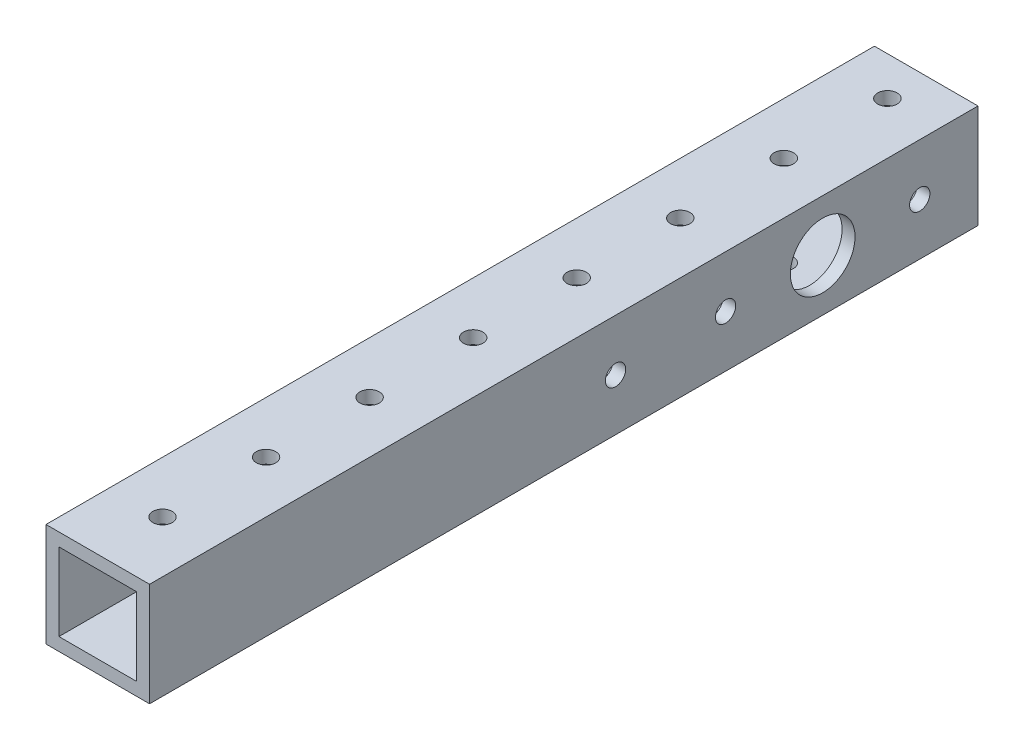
ISO-10303-21;
HEADER;
FILE_DESCRIPTION(('STEP AP214'),'2;1');
FILE_NAME('part.step','',(''),(''),'','','');
FILE_SCHEMA(('AUTOMOTIVE_DESIGN { 1 0 10303 214 1 1 1 1 }'));
ENDSEC;
DATA;
#1=APPLICATION_CONTEXT('core data for automotive mechanical design processes');
#2=APPLICATION_PROTOCOL_DEFINITION('international standard','automotive_design',2000,#1);
#3=PRODUCT_CONTEXT('',#1,'mechanical');
#4=PRODUCT('Part','Part','',(#3));
#5=PRODUCT_RELATED_PRODUCT_CATEGORY('part','',(#4));
#6=PRODUCT_DEFINITION_FORMATION('','',#4);
#7=PRODUCT_DEFINITION_CONTEXT('part definition',#1,'design');
#8=PRODUCT_DEFINITION('design','',#6,#7);
#9=PRODUCT_DEFINITION_SHAPE('','',#8);
#10=(LENGTH_UNIT() NAMED_UNIT(*) SI_UNIT(.MILLI.,.METRE.));
#11=(NAMED_UNIT(*) PLANE_ANGLE_UNIT() SI_UNIT($,.RADIAN.));
#12=(NAMED_UNIT(*) SI_UNIT($,.STERADIAN.) SOLID_ANGLE_UNIT());
#13=UNCERTAINTY_MEASURE_WITH_UNIT(LENGTH_MEASURE(1.E-05),#10,'distance_accuracy_value','');
#14=(GEOMETRIC_REPRESENTATION_CONTEXT(3) GLOBAL_UNCERTAINTY_ASSIGNED_CONTEXT((#13)) GLOBAL_UNIT_ASSIGNED_CONTEXT((#10,
#11,#12)) REPRESENTATION_CONTEXT('',''));
#15=CARTESIAN_POINT('',(0.,0.,0.));
#16=DIRECTION('',(0.,0.,1.));
#17=DIRECTION('',(1.,0.,0.));
#18=AXIS2_PLACEMENT_3D('',#15,#16,#17);
#19=CARTESIAN_POINT('',(0.,0.,101.6));
#20=DIRECTION('',(0.,0.,-1.));
#21=DIRECTION('',(-1.,0.,0.));
#22=AXIS2_PLACEMENT_3D('',#19,#20,#21);
#23=PLANE('',#22);
#24=DIRECTION('',(0.,1.,0.));
#25=VECTOR('',#24,1.);
#26=CARTESIAN_POINT('',(12.7,-12.7,101.6));
#27=LINE('',#26,#25);
#28=CARTESIAN_POINT('',(12.7,-12.7,101.6));
#29=VERTEX_POINT('',#28);
#30=CARTESIAN_POINT('',(12.7,12.7,101.6));
#31=VERTEX_POINT('',#30);
#32=EDGE_CURVE('E139',#29,#31,#27,.T.);
#33=ORIENTED_EDGE('',*,*,#32,.T.);
#34=DIRECTION('',(-1.,0.,0.));
#35=VECTOR('',#34,1.);
#36=CARTESIAN_POINT('',(-12.7,12.7,101.6));
#37=LINE('',#36,#35);
#38=CARTESIAN_POINT('',(-12.7,12.7,101.6));
#39=VERTEX_POINT('',#38);
#40=EDGE_CURVE('E142',#31,#39,#37,.T.);
#41=ORIENTED_EDGE('',*,*,#40,.T.);
#42=DIRECTION('',(0.,-1.,0.));
#43=VECTOR('',#42,1.);
#44=CARTESIAN_POINT('',(-12.7,-12.7,101.6));
#45=LINE('',#44,#43);
#46=CARTESIAN_POINT('',(-12.7,-12.7,101.6));
#47=VERTEX_POINT('',#46);
#48=EDGE_CURVE('E145',#39,#47,#45,.T.);
#49=ORIENTED_EDGE('',*,*,#48,.T.);
#50=DIRECTION('',(1.,0.,0.));
#51=VECTOR('',#50,1.);
#52=CARTESIAN_POINT('',(-12.7,-12.7,101.6));
#53=LINE('',#52,#51);
#54=EDGE_CURVE('E147',#47,#29,#53,.T.);
#55=ORIENTED_EDGE('',*,*,#54,.T.);
#56=EDGE_LOOP('',(#33,#41,#49,#55));
#57=FACE_BOUND('',#56,.T.);
#58=DIRECTION('',(0.,1.,0.));
#59=VECTOR('',#58,1.);
#60=CARTESIAN_POINT('',(9.525,-9.525,101.6));
#61=LINE('',#60,#59);
#62=CARTESIAN_POINT('',(9.525,-9.525,101.6));
#63=VERTEX_POINT('',#62);
#64=CARTESIAN_POINT('',(9.525,9.525,101.6));
#65=VERTEX_POINT('',#64);
#66=EDGE_CURVE('E100',#63,#65,#61,.T.);
#67=ORIENTED_EDGE('',*,*,#66,.F.);
#68=DIRECTION('',(1.,0.,0.));
#69=VECTOR('',#68,1.);
#70=CARTESIAN_POINT('',(-9.525,-9.525,101.6));
#71=LINE('',#70,#69);
#72=CARTESIAN_POINT('',(-9.525,-9.525,101.6));
#73=VERTEX_POINT('',#72);
#74=EDGE_CURVE('E123',#73,#63,#71,.T.);
#75=ORIENTED_EDGE('',*,*,#74,.F.);
#76=DIRECTION('',(0.,-1.,0.));
#77=VECTOR('',#76,1.);
#78=CARTESIAN_POINT('',(-9.525,-9.525,101.6));
#79=LINE('',#78,#77);
#80=CARTESIAN_POINT('',(-9.525,9.525,101.6));
#81=VERTEX_POINT('',#80);
#82=EDGE_CURVE('E121',#81,#73,#79,.T.);
#83=ORIENTED_EDGE('',*,*,#82,.F.);
#84=DIRECTION('',(-1.,0.,0.));
#85=VECTOR('',#84,1.);
#86=CARTESIAN_POINT('',(-9.525,9.525,101.6));
#87=LINE('',#86,#85);
#88=EDGE_CURVE('E108',#65,#81,#87,.T.);
#89=ORIENTED_EDGE('',*,*,#88,.F.);
#90=EDGE_LOOP('',(#67,#75,#83,#89));
#91=FACE_BOUND('',#90,.T.);
#92=ADVANCED_FACE('F35',(#57,#91),#23,.F.);
#93=CARTESIAN_POINT('',(0.,0.,-101.6));
#94=DIRECTION('',(0.,0.,-1.));
#95=DIRECTION('',(-1.,0.,0.));
#96=AXIS2_PLACEMENT_3D('',#93,#94,#95);
#97=PLANE('',#96);
#98=DIRECTION('',(0.,1.,0.));
#99=VECTOR('',#98,1.);
#100=CARTESIAN_POINT('',(12.7,-12.7,-101.6));
#101=LINE('',#100,#99);
#102=CARTESIAN_POINT('',(12.7,-12.7,-101.6));
#103=VERTEX_POINT('',#102);
#104=CARTESIAN_POINT('',(12.7,12.7,-101.6));
#105=VERTEX_POINT('',#104);
#106=EDGE_CURVE('E117',#103,#105,#101,.T.);
#107=ORIENTED_EDGE('',*,*,#106,.F.);
#108=DIRECTION('',(1.,0.,0.));
#109=VECTOR('',#108,1.);
#110=CARTESIAN_POINT('',(-12.7,-12.7,-101.6));
#111=LINE('',#110,#109);
#112=CARTESIAN_POINT('',(-12.7,-12.7,-101.6));
#113=VERTEX_POINT('',#112);
#114=EDGE_CURVE('E143',#113,#103,#111,.T.);
#115=ORIENTED_EDGE('',*,*,#114,.F.);
#116=DIRECTION('',(0.,-1.,0.));
#117=VECTOR('',#116,1.);
#118=CARTESIAN_POINT('',(-12.7,-12.7,-101.6));
#119=LINE('',#118,#117);
#120=CARTESIAN_POINT('',(-12.7,12.7,-101.6));
#121=VERTEX_POINT('',#120);
#122=EDGE_CURVE('E154',#121,#113,#119,.T.);
#123=ORIENTED_EDGE('',*,*,#122,.F.);
#124=DIRECTION('',(-1.,0.,0.));
#125=VECTOR('',#124,1.);
#126=CARTESIAN_POINT('',(-12.7,12.7,-101.6));
#127=LINE('',#126,#125);
#128=EDGE_CURVE('E152',#105,#121,#127,.T.);
#129=ORIENTED_EDGE('',*,*,#128,.F.);
#130=EDGE_LOOP('',(#107,#115,#123,#129));
#131=FACE_BOUND('',#130,.T.);
#132=DIRECTION('',(1.,0.,0.));
#133=VECTOR('',#132,1.);
#134=CARTESIAN_POINT('',(-9.525,-9.525,-101.6));
#135=LINE('',#134,#133);
#136=CARTESIAN_POINT('',(-9.525,-9.525,-101.6));
#137=VERTEX_POINT('',#136);
#138=CARTESIAN_POINT('',(9.525,-9.525,-101.6));
#139=VERTEX_POINT('',#138);
#140=EDGE_CURVE('E109',#137,#139,#135,.T.);
#141=ORIENTED_EDGE('',*,*,#140,.T.);
#142=DIRECTION('',(0.,1.,0.));
#143=VECTOR('',#142,1.);
#144=CARTESIAN_POINT('',(9.525,-9.525,-101.6));
#145=LINE('',#144,#143);
#146=CARTESIAN_POINT('',(9.525,9.525,-101.6));
#147=VERTEX_POINT('',#146);
#148=EDGE_CURVE('E58',#139,#147,#145,.T.);
#149=ORIENTED_EDGE('',*,*,#148,.T.);
#150=DIRECTION('',(-1.,0.,0.));
#151=VECTOR('',#150,1.);
#152=CARTESIAN_POINT('',(-9.525,9.525,-101.6));
#153=LINE('',#152,#151);
#154=CARTESIAN_POINT('',(-9.525,9.525,-101.6));
#155=VERTEX_POINT('',#154);
#156=EDGE_CURVE('E116',#147,#155,#153,.T.);
#157=ORIENTED_EDGE('',*,*,#156,.T.);
#158=DIRECTION('',(0.,-1.,0.));
#159=VECTOR('',#158,1.);
#160=CARTESIAN_POINT('',(-9.525,-9.525,-101.6));
#161=LINE('',#160,#159);
#162=EDGE_CURVE('E131',#155,#137,#161,.T.);
#163=ORIENTED_EDGE('',*,*,#162,.T.);
#164=EDGE_LOOP('',(#141,#149,#157,#163));
#165=FACE_BOUND('',#164,.T.);
#166=ADVANCED_FACE('F266',(#131,#165),#97,.T.);
#167=CARTESIAN_POINT('',(12.7,-12.7,101.6));
#168=DIRECTION('',(-1.,0.,0.));
#169=DIRECTION('',(0.,0.,1.));
#170=AXIS2_PLACEMENT_3D('',#167,#168,#169);
#171=PLANE('',#170);
#172=CARTESIAN_POINT('',(12.7,0.,-63.5));
#173=DIRECTION('',(1.,0.,0.));
#174=DIRECTION('',(0.,0.,-1.));
#175=AXIS2_PLACEMENT_3D('',#172,#173,#174);
#176=CIRCLE('',#175,7.93749999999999);
#177=CARTESIAN_POINT('',(12.7,0.,-71.4375));
#178=VERTEX_POINT('',#177);
#179=EDGE_CURVE('E427',#178,#178,#176,.T.);
#180=ORIENTED_EDGE('',*,*,#179,.F.);
#181=EDGE_LOOP('',(#180));
#182=FACE_BOUND('',#181,.T.);
#183=CARTESIAN_POINT('',(12.7,0.,-87.3125));
#184=DIRECTION('',(1.,0.,0.));
#185=DIRECTION('',(0.,0.,-1.));
#186=AXIS2_PLACEMENT_3D('',#183,#184,#185);
#187=CIRCLE('',#186,2.4892);
#188=CARTESIAN_POINT('',(12.7,0.,-89.8017));
#189=VERTEX_POINT('',#188);
#190=EDGE_CURVE('E401',#189,#189,#187,.T.);
#191=ORIENTED_EDGE('',*,*,#190,.F.);
#192=EDGE_LOOP('',(#191));
#193=FACE_BOUND('',#192,.T.);
#194=CARTESIAN_POINT('',(12.7,0.,-39.6875));
#195=DIRECTION('',(1.,0.,0.));
#196=DIRECTION('',(0.,0.,-1.));
#197=AXIS2_PLACEMENT_3D('',#194,#195,#196);
#198=CIRCLE('',#197,2.4892);
#199=CARTESIAN_POINT('',(12.7,0.,-42.1767));
#200=VERTEX_POINT('',#199);
#201=EDGE_CURVE('E394',#200,#200,#198,.T.);
#202=ORIENTED_EDGE('',*,*,#201,.F.);
#203=EDGE_LOOP('',(#202));
#204=FACE_BOUND('',#203,.T.);
#205=CARTESIAN_POINT('',(12.7,0.,-12.7));
#206=DIRECTION('',(1.,0.,0.));
#207=DIRECTION('',(0.,0.,-1.));
#208=AXIS2_PLACEMENT_3D('',#205,#206,#207);
#209=CIRCLE('',#208,2.4892);
#210=CARTESIAN_POINT('',(12.7,0.,-15.1892));
#211=VERTEX_POINT('',#210);
#212=EDGE_CURVE('E398',#211,#211,#209,.T.);
#213=ORIENTED_EDGE('',*,*,#212,.F.);
#214=EDGE_LOOP('',(#213));
#215=FACE_BOUND('',#214,.T.);
#216=ORIENTED_EDGE('',*,*,#106,.T.);
#217=DIRECTION('',(0.,0.,-1.));
#218=VECTOR('',#217,1.);
#219=CARTESIAN_POINT('',(12.7,12.7,101.6));
#220=LINE('',#219,#218);
#221=EDGE_CURVE('E165',#31,#105,#220,.T.);
#222=ORIENTED_EDGE('',*,*,#221,.F.);
#223=ORIENTED_EDGE('',*,*,#32,.F.);
#224=DIRECTION('',(0.,0.,-1.));
#225=VECTOR('',#224,1.);
#226=CARTESIAN_POINT('',(12.7,-12.7,101.6));
#227=LINE('',#226,#225);
#228=EDGE_CURVE('E149',#29,#103,#227,.T.);
#229=ORIENTED_EDGE('',*,*,#228,.T.);
#230=EDGE_LOOP('',(#216,#222,#223,#229));
#231=FACE_BOUND('',#230,.T.);
#232=ADVANCED_FACE('F272',(#182,#193,#204,#215,#231),#171,.F.);
#233=CARTESIAN_POINT('',(-12.7,12.7,101.6));
#234=DIRECTION('',(0.,-1.,0.));
#235=DIRECTION('',(0.,0.,-1.));
#236=AXIS2_PLACEMENT_3D('',#233,#234,#235);
#237=PLANE('',#236);
#238=CARTESIAN_POINT('',(0.,12.7,-66.675));
#239=DIRECTION('',(0.,1.,0.));
#240=DIRECTION('',(0.,0.,1.));
#241=AXIS2_PLACEMENT_3D('',#238,#239,#240);
#242=CIRCLE('',#241,2.38125);
#243=CARTESIAN_POINT('',(0.,12.7,-64.29375));
#244=VERTEX_POINT('',#243);
#245=EDGE_CURVE('E437',#244,#244,#242,.T.);
#246=ORIENTED_EDGE('',*,*,#245,.F.);
#247=EDGE_LOOP('',(#246));
#248=FACE_BOUND('',#247,.T.);
#249=CARTESIAN_POINT('',(0.,12.7,-92.075));
#250=DIRECTION('',(0.,1.,0.));
#251=DIRECTION('',(0.,0.,1.));
#252=AXIS2_PLACEMENT_3D('',#249,#250,#251);
#253=CIRCLE('',#252,2.38125);
#254=CARTESIAN_POINT('',(0.,12.7,-89.69375));
#255=VERTEX_POINT('',#254);
#256=EDGE_CURVE('E434',#255,#255,#253,.T.);
#257=ORIENTED_EDGE('',*,*,#256,.F.);
#258=EDGE_LOOP('',(#257));
#259=FACE_BOUND('',#258,.T.);
#260=ORIENTED_EDGE('',*,*,#128,.T.);
#261=DIRECTION('',(0.,0.,-1.));
#262=VECTOR('',#261,1.);
#263=CARTESIAN_POINT('',(-12.7,12.7,101.6));
#264=LINE('',#263,#262);
#265=EDGE_CURVE('E162',#39,#121,#264,.T.);
#266=ORIENTED_EDGE('',*,*,#265,.F.);
#267=ORIENTED_EDGE('',*,*,#40,.F.);
#268=ORIENTED_EDGE('',*,*,#221,.T.);
#269=EDGE_LOOP('',(#260,#266,#267,#268));
#270=FACE_BOUND('',#269,.T.);
#271=CARTESIAN_POINT('',(0.,12.7,-41.275));
#272=DIRECTION('',(0.,1.,0.));
#273=DIRECTION('',(0.,0.,1.));
#274=AXIS2_PLACEMENT_3D('',#271,#272,#273);
#275=CIRCLE('',#274,2.38125);
#276=CARTESIAN_POINT('',(0.,12.7,-38.89375));
#277=VERTEX_POINT('',#276);
#278=EDGE_CURVE('E181',#277,#277,#275,.T.);
#279=ORIENTED_EDGE('',*,*,#278,.F.);
#280=EDGE_LOOP('',(#279));
#281=FACE_BOUND('',#280,.T.);
#282=CARTESIAN_POINT('',(0.,12.7,-15.875));
#283=DIRECTION('',(0.,1.,0.));
#284=DIRECTION('',(0.,0.,1.));
#285=AXIS2_PLACEMENT_3D('',#282,#283,#284);
#286=CIRCLE('',#285,2.38125);
#287=CARTESIAN_POINT('',(0.,12.7,-13.49375));
#288=VERTEX_POINT('',#287);
#289=EDGE_CURVE('E187',#288,#288,#286,.T.);
#290=ORIENTED_EDGE('',*,*,#289,.F.);
#291=EDGE_LOOP('',(#290));
#292=FACE_BOUND('',#291,.T.);
#293=CARTESIAN_POINT('',(0.,12.7,9.52500000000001));
#294=DIRECTION('',(0.,1.,0.));
#295=DIRECTION('',(0.,0.,1.));
#296=AXIS2_PLACEMENT_3D('',#293,#294,#295);
#297=CIRCLE('',#296,2.38125);
#298=CARTESIAN_POINT('',(0.,12.7,11.90625));
#299=VERTEX_POINT('',#298);
#300=EDGE_CURVE('E193',#299,#299,#297,.T.);
#301=ORIENTED_EDGE('',*,*,#300,.F.);
#302=EDGE_LOOP('',(#301));
#303=FACE_BOUND('',#302,.T.);
#304=CARTESIAN_POINT('',(0.,12.7,34.925));
#305=DIRECTION('',(0.,1.,0.));
#306=DIRECTION('',(0.,0.,1.));
#307=AXIS2_PLACEMENT_3D('',#304,#305,#306);
#308=CIRCLE('',#307,2.38125);
#309=CARTESIAN_POINT('',(0.,12.7,37.30625));
#310=VERTEX_POINT('',#309);
#311=EDGE_CURVE('E199',#310,#310,#308,.T.);
#312=ORIENTED_EDGE('',*,*,#311,.F.);
#313=EDGE_LOOP('',(#312));
#314=FACE_BOUND('',#313,.T.);
#315=CARTESIAN_POINT('',(0.,12.7,60.325));
#316=DIRECTION('',(0.,1.,0.));
#317=DIRECTION('',(0.,0.,1.));
#318=AXIS2_PLACEMENT_3D('',#315,#316,#317);
#319=CIRCLE('',#318,2.38125);
#320=CARTESIAN_POINT('',(0.,12.7,62.70625));
#321=VERTEX_POINT('',#320);
#322=EDGE_CURVE('E205',#321,#321,#319,.T.);
#323=ORIENTED_EDGE('',*,*,#322,.F.);
#324=EDGE_LOOP('',(#323));
#325=FACE_BOUND('',#324,.T.);
#326=CARTESIAN_POINT('',(0.,12.7,85.725));
#327=DIRECTION('',(0.,1.,0.));
#328=DIRECTION('',(0.,0.,1.));
#329=AXIS2_PLACEMENT_3D('',#326,#327,#328);
#330=CIRCLE('',#329,2.38125);
#331=CARTESIAN_POINT('',(0.,12.7,88.10625));
#332=VERTEX_POINT('',#331);
#333=EDGE_CURVE('E211',#332,#332,#330,.T.);
#334=ORIENTED_EDGE('',*,*,#333,.F.);
#335=EDGE_LOOP('',(#334));
#336=FACE_BOUND('',#335,.T.);
#337=ADVANCED_FACE('F285',(#248,#259,#270,#281,#292,#303,#314,#325,#336),#237,.F.);
#338=CARTESIAN_POINT('',(-12.7,-12.7,101.6));
#339=DIRECTION('',(1.,0.,0.));
#340=DIRECTION('',(0.,0.,-1.));
#341=AXIS2_PLACEMENT_3D('',#338,#339,#340);
#342=PLANE('',#341);
#343=CARTESIAN_POINT('',(-12.7,0.,-12.7));
#344=DIRECTION('',(1.,0.,0.));
#345=DIRECTION('',(0.,0.,-1.));
#346=AXIS2_PLACEMENT_3D('',#343,#344,#345);
#347=CIRCLE('',#346,4.7625);
#348=CARTESIAN_POINT('',(-12.7,0.,-17.4625));
#349=VERTEX_POINT('',#348);
#350=EDGE_CURVE('E461',#349,#349,#347,.F.);
#351=ORIENTED_EDGE('',*,*,#350,.F.);
#352=EDGE_LOOP('',(#351));
#353=FACE_BOUND('',#352,.T.);
#354=CARTESIAN_POINT('',(-12.7,0.,-39.6875));
#355=DIRECTION('',(-1.,0.,0.));
#356=DIRECTION('',(0.,0.,1.));
#357=AXIS2_PLACEMENT_3D('',#354,#355,#356);
#358=CIRCLE('',#357,4.7625);
#359=CARTESIAN_POINT('',(-12.7,0.,-34.925));
#360=VERTEX_POINT('',#359);
#361=EDGE_CURVE('E455',#360,#360,#358,.T.);
#362=ORIENTED_EDGE('',*,*,#361,.F.);
#363=EDGE_LOOP('',(#362));
#364=FACE_BOUND('',#363,.T.);
#365=CARTESIAN_POINT('',(-12.7,0.,-87.3125));
#366=DIRECTION('',(-1.,0.,0.));
#367=DIRECTION('',(0.,0.,1.));
#368=AXIS2_PLACEMENT_3D('',#365,#366,#367);
#369=CIRCLE('',#368,4.7625);
#370=CARTESIAN_POINT('',(-12.7,0.,-82.55));
#371=VERTEX_POINT('',#370);
#372=EDGE_CURVE('E451',#371,#371,#369,.T.);
#373=ORIENTED_EDGE('',*,*,#372,.F.);
#374=EDGE_LOOP('',(#373));
#375=FACE_BOUND('',#374,.T.);
#376=CARTESIAN_POINT('',(-12.7,0.,-63.5));
#377=DIRECTION('',(1.,0.,0.));
#378=DIRECTION('',(0.,0.,-1.));
#379=AXIS2_PLACEMENT_3D('',#376,#377,#378);
#380=CIRCLE('',#379,7.93749999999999);
#381=CARTESIAN_POINT('',(-12.7,0.,-71.4375));
#382=VERTEX_POINT('',#381);
#383=EDGE_CURVE('E173',#382,#382,#380,.T.);
#384=ORIENTED_EDGE('',*,*,#383,.T.);
#385=EDGE_LOOP('',(#384));
#386=FACE_BOUND('',#385,.T.);
#387=ORIENTED_EDGE('',*,*,#122,.T.);
#388=DIRECTION('',(0.,0.,-1.));
#389=VECTOR('',#388,1.);
#390=CARTESIAN_POINT('',(-12.7,-12.7,101.6));
#391=LINE('',#390,#389);
#392=EDGE_CURVE('E159',#47,#113,#391,.T.);
#393=ORIENTED_EDGE('',*,*,#392,.F.);
#394=ORIENTED_EDGE('',*,*,#48,.F.);
#395=ORIENTED_EDGE('',*,*,#265,.T.);
#396=EDGE_LOOP('',(#387,#393,#394,#395));
#397=FACE_BOUND('',#396,.T.);
#398=ADVANCED_FACE('F281',(#353,#364,#375,#386,#397),#342,.F.);
#399=CARTESIAN_POINT('',(-12.7,-12.7,101.6));
#400=DIRECTION('',(0.,1.,0.));
#401=DIRECTION('',(0.,0.,1.));
#402=AXIS2_PLACEMENT_3D('',#399,#400,#401);
#403=PLANE('',#402);
#404=CARTESIAN_POINT('',(0.,-12.7,-66.675));
#405=DIRECTION('',(0.,1.,0.));
#406=DIRECTION('',(0.,0.,1.));
#407=AXIS2_PLACEMENT_3D('',#404,#405,#406);
#408=CIRCLE('',#407,2.38125);
#409=CARTESIAN_POINT('',(0.,-12.7,-64.29375));
#410=VERTEX_POINT('',#409);
#411=EDGE_CURVE('E445',#410,#410,#408,.T.);
#412=ORIENTED_EDGE('',*,*,#411,.T.);
#413=EDGE_LOOP('',(#412));
#414=FACE_BOUND('',#413,.T.);
#415=CARTESIAN_POINT('',(0.,-12.7,-92.075));
#416=DIRECTION('',(0.,1.,0.));
#417=DIRECTION('',(0.,0.,1.));
#418=AXIS2_PLACEMENT_3D('',#415,#416,#417);
#419=CIRCLE('',#418,2.38125);
#420=CARTESIAN_POINT('',(0.,-12.7,-89.69375));
#421=VERTEX_POINT('',#420);
#422=EDGE_CURVE('E178',#421,#421,#419,.T.);
#423=ORIENTED_EDGE('',*,*,#422,.T.);
#424=EDGE_LOOP('',(#423));
#425=FACE_BOUND('',#424,.T.);
#426=ORIENTED_EDGE('',*,*,#114,.T.);
#427=ORIENTED_EDGE('',*,*,#228,.F.);
#428=ORIENTED_EDGE('',*,*,#54,.F.);
#429=ORIENTED_EDGE('',*,*,#392,.T.);
#430=EDGE_LOOP('',(#426,#427,#428,#429));
#431=FACE_BOUND('',#430,.T.);
#432=CARTESIAN_POINT('',(0.,-12.7,-41.275));
#433=DIRECTION('',(0.,1.,0.));
#434=DIRECTION('',(0.,0.,1.));
#435=AXIS2_PLACEMENT_3D('',#432,#433,#434);
#436=CIRCLE('',#435,2.38125);
#437=CARTESIAN_POINT('',(0.,-12.7,-38.89375));
#438=VERTEX_POINT('',#437);
#439=EDGE_CURVE('E217',#438,#438,#436,.T.);
#440=ORIENTED_EDGE('',*,*,#439,.T.);
#441=EDGE_LOOP('',(#440));
#442=FACE_BOUND('',#441,.T.);
#443=CARTESIAN_POINT('',(0.,-12.7,-15.875));
#444=DIRECTION('',(0.,1.,0.));
#445=DIRECTION('',(0.,0.,1.));
#446=AXIS2_PLACEMENT_3D('',#443,#444,#445);
#447=CIRCLE('',#446,2.38125);
#448=CARTESIAN_POINT('',(0.,-12.7,-13.49375));
#449=VERTEX_POINT('',#448);
#450=EDGE_CURVE('E223',#449,#449,#447,.T.);
#451=ORIENTED_EDGE('',*,*,#450,.T.);
#452=EDGE_LOOP('',(#451));
#453=FACE_BOUND('',#452,.T.);
#454=CARTESIAN_POINT('',(0.,-12.7,9.52500000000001));
#455=DIRECTION('',(0.,1.,0.));
#456=DIRECTION('',(0.,0.,1.));
#457=AXIS2_PLACEMENT_3D('',#454,#455,#456);
#458=CIRCLE('',#457,2.38125);
#459=CARTESIAN_POINT('',(0.,-12.7,11.90625));
#460=VERTEX_POINT('',#459);
#461=EDGE_CURVE('E229',#460,#460,#458,.T.);
#462=ORIENTED_EDGE('',*,*,#461,.T.);
#463=EDGE_LOOP('',(#462));
#464=FACE_BOUND('',#463,.T.);
#465=CARTESIAN_POINT('',(0.,-12.7,34.925));
#466=DIRECTION('',(0.,1.,0.));
#467=DIRECTION('',(0.,0.,1.));
#468=AXIS2_PLACEMENT_3D('',#465,#466,#467);
#469=CIRCLE('',#468,2.38125);
#470=CARTESIAN_POINT('',(0.,-12.7,37.30625));
#471=VERTEX_POINT('',#470);
#472=EDGE_CURVE('E235',#471,#471,#469,.T.);
#473=ORIENTED_EDGE('',*,*,#472,.T.);
#474=EDGE_LOOP('',(#473));
#475=FACE_BOUND('',#474,.T.);
#476=CARTESIAN_POINT('',(0.,-12.7,60.325));
#477=DIRECTION('',(0.,1.,0.));
#478=DIRECTION('',(0.,0.,1.));
#479=AXIS2_PLACEMENT_3D('',#476,#477,#478);
#480=CIRCLE('',#479,2.38125);
#481=CARTESIAN_POINT('',(0.,-12.7,62.70625));
#482=VERTEX_POINT('',#481);
#483=EDGE_CURVE('E241',#482,#482,#480,.T.);
#484=ORIENTED_EDGE('',*,*,#483,.T.);
#485=EDGE_LOOP('',(#484));
#486=FACE_BOUND('',#485,.T.);
#487=CARTESIAN_POINT('',(0.,-12.7,85.725));
#488=DIRECTION('',(0.,1.,0.));
#489=DIRECTION('',(0.,0.,1.));
#490=AXIS2_PLACEMENT_3D('',#487,#488,#489);
#491=CIRCLE('',#490,2.38125);
#492=CARTESIAN_POINT('',(0.,-12.7,88.10625));
#493=VERTEX_POINT('',#492);
#494=EDGE_CURVE('E11',#493,#493,#491,.T.);
#495=ORIENTED_EDGE('',*,*,#494,.T.);
#496=EDGE_LOOP('',(#495));
#497=FACE_BOUND('',#496,.T.);
#498=ADVANCED_FACE('F278',(#414,#425,#431,#442,#453,#464,#475,#486,#497),#403,.F.);
#499=CARTESIAN_POINT('',(9.525,-9.525,101.6));
#500=DIRECTION('',(-1.,0.,0.));
#501=DIRECTION('',(0.,0.,1.));
#502=AXIS2_PLACEMENT_3D('',#499,#500,#501);
#503=PLANE('',#502);
#504=CARTESIAN_POINT('',(9.525,0.,-63.5));
#505=DIRECTION('',(-1.,0.,0.));
#506=DIRECTION('',(0.,0.,1.));
#507=AXIS2_PLACEMENT_3D('',#504,#505,#506);
#508=CIRCLE('',#507,7.93749999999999);
#509=CARTESIAN_POINT('',(9.525,0.,-55.5625));
#510=VERTEX_POINT('',#509);
#511=EDGE_CURVE('E172',#510,#510,#508,.T.);
#512=ORIENTED_EDGE('',*,*,#511,.F.);
#513=EDGE_LOOP('',(#512));
#514=FACE_BOUND('',#513,.T.);
#515=CARTESIAN_POINT('',(9.525,0.,-87.3125));
#516=DIRECTION('',(-1.,0.,0.));
#517=DIRECTION('',(0.,0.,1.));
#518=AXIS2_PLACEMENT_3D('',#515,#516,#517);
#519=CIRCLE('',#518,2.4892);
#520=CARTESIAN_POINT('',(9.525,0.,-84.8233));
#521=VERTEX_POINT('',#520);
#522=EDGE_CURVE('E396',#521,#521,#519,.T.);
#523=ORIENTED_EDGE('',*,*,#522,.F.);
#524=EDGE_LOOP('',(#523));
#525=FACE_BOUND('',#524,.T.);
#526=CARTESIAN_POINT('',(9.525,0.,-39.6875));
#527=DIRECTION('',(-1.,0.,0.));
#528=DIRECTION('',(0.,0.,1.));
#529=AXIS2_PLACEMENT_3D('',#526,#527,#528);
#530=CIRCLE('',#529,2.4892);
#531=CARTESIAN_POINT('',(9.525,0.,-37.1983));
#532=VERTEX_POINT('',#531);
#533=EDGE_CURVE('E391',#532,#532,#530,.T.);
#534=ORIENTED_EDGE('',*,*,#533,.F.);
#535=EDGE_LOOP('',(#534));
#536=FACE_BOUND('',#535,.T.);
#537=CARTESIAN_POINT('',(9.525,0.,-12.7));
#538=DIRECTION('',(-1.,0.,0.));
#539=DIRECTION('',(0.,0.,1.));
#540=AXIS2_PLACEMENT_3D('',#537,#538,#539);
#541=CIRCLE('',#540,2.4892);
#542=CARTESIAN_POINT('',(9.525,0.,-10.2108));
#543=VERTEX_POINT('',#542);
#544=EDGE_CURVE('E129',#543,#543,#541,.T.);
#545=ORIENTED_EDGE('',*,*,#544,.F.);
#546=EDGE_LOOP('',(#545));
#547=FACE_BOUND('',#546,.T.);
#548=ORIENTED_EDGE('',*,*,#148,.F.);
#549=DIRECTION('',(0.,0.,-1.));
#550=VECTOR('',#549,1.);
#551=CARTESIAN_POINT('',(9.525,-9.525,101.6));
#552=LINE('',#551,#550);
#553=EDGE_CURVE('E104',#63,#139,#552,.T.);
#554=ORIENTED_EDGE('',*,*,#553,.F.);
#555=ORIENTED_EDGE('',*,*,#66,.T.);
#556=DIRECTION('',(0.,0.,-1.));
#557=VECTOR('',#556,1.);
#558=CARTESIAN_POINT('',(9.525,9.525,101.6));
#559=LINE('',#558,#557);
#560=EDGE_CURVE('E103',#65,#147,#559,.T.);
#561=ORIENTED_EDGE('',*,*,#560,.T.);
#562=EDGE_LOOP('',(#548,#554,#555,#561));
#563=FACE_BOUND('',#562,.T.);
#564=ADVANCED_FACE('F102',(#514,#525,#536,#547,#563),#503,.T.);
#565=CARTESIAN_POINT('',(-9.525,9.525,101.6));
#566=DIRECTION('',(0.,-1.,0.));
#567=DIRECTION('',(0.,0.,-1.));
#568=AXIS2_PLACEMENT_3D('',#565,#566,#567);
#569=PLANE('',#568);
#570=CARTESIAN_POINT('',(0.,9.525,-66.675));
#571=DIRECTION('',(0.,-1.,0.));
#572=DIRECTION('',(0.,0.,-1.));
#573=AXIS2_PLACEMENT_3D('',#570,#571,#572);
#574=CIRCLE('',#573,2.38125);
#575=CARTESIAN_POINT('',(0.,9.525,-69.05625));
#576=VERTEX_POINT('',#575);
#577=EDGE_CURVE('E442',#576,#576,#574,.T.);
#578=ORIENTED_EDGE('',*,*,#577,.F.);
#579=EDGE_LOOP('',(#578));
#580=FACE_BOUND('',#579,.T.);
#581=CARTESIAN_POINT('',(0.,9.525,-92.075));
#582=DIRECTION('',(0.,-1.,0.));
#583=DIRECTION('',(0.,0.,-1.));
#584=AXIS2_PLACEMENT_3D('',#581,#582,#583);
#585=CIRCLE('',#584,2.38125);
#586=CARTESIAN_POINT('',(0.,9.525,-94.45625));
#587=VERTEX_POINT('',#586);
#588=EDGE_CURVE('E177',#587,#587,#585,.T.);
#589=ORIENTED_EDGE('',*,*,#588,.F.);
#590=EDGE_LOOP('',(#589));
#591=FACE_BOUND('',#590,.T.);
#592=ORIENTED_EDGE('',*,*,#156,.F.);
#593=ORIENTED_EDGE('',*,*,#560,.F.);
#594=ORIENTED_EDGE('',*,*,#88,.T.);
#595=DIRECTION('',(0.,0.,-1.));
#596=VECTOR('',#595,1.);
#597=CARTESIAN_POINT('',(-9.525,9.525,101.6));
#598=LINE('',#597,#596);
#599=EDGE_CURVE('E118',#81,#155,#598,.T.);
#600=ORIENTED_EDGE('',*,*,#599,.T.);
#601=EDGE_LOOP('',(#592,#593,#594,#600));
#602=FACE_BOUND('',#601,.T.);
#603=CARTESIAN_POINT('',(0.,9.525,-41.275));
#604=DIRECTION('',(0.,-1.,0.));
#605=DIRECTION('',(0.,0.,-1.));
#606=AXIS2_PLACEMENT_3D('',#603,#604,#605);
#607=CIRCLE('',#606,2.38125);
#608=CARTESIAN_POINT('',(0.,9.525,-43.65625));
#609=VERTEX_POINT('',#608);
#610=EDGE_CURVE('E168',#609,#609,#607,.T.);
#611=ORIENTED_EDGE('',*,*,#610,.F.);
#612=EDGE_LOOP('',(#611));
#613=FACE_BOUND('',#612,.T.);
#614=CARTESIAN_POINT('',(0.,9.525,-15.875));
#615=DIRECTION('',(0.,-1.,0.));
#616=DIRECTION('',(0.,0.,-1.));
#617=AXIS2_PLACEMENT_3D('',#614,#615,#616);
#618=CIRCLE('',#617,2.38125);
#619=CARTESIAN_POINT('',(0.,9.525,-18.25625));
#620=VERTEX_POINT('',#619);
#621=EDGE_CURVE('E184',#620,#620,#618,.T.);
#622=ORIENTED_EDGE('',*,*,#621,.F.);
#623=EDGE_LOOP('',(#622));
#624=FACE_BOUND('',#623,.T.);
#625=CARTESIAN_POINT('',(0.,9.525,9.52500000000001));
#626=DIRECTION('',(0.,-1.,0.));
#627=DIRECTION('',(0.,0.,-1.));
#628=AXIS2_PLACEMENT_3D('',#625,#626,#627);
#629=CIRCLE('',#628,2.38125);
#630=CARTESIAN_POINT('',(0.,9.525,7.14375000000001));
#631=VERTEX_POINT('',#630);
#632=EDGE_CURVE('E190',#631,#631,#629,.T.);
#633=ORIENTED_EDGE('',*,*,#632,.F.);
#634=EDGE_LOOP('',(#633));
#635=FACE_BOUND('',#634,.T.);
#636=CARTESIAN_POINT('',(0.,9.525,34.925));
#637=DIRECTION('',(0.,-1.,0.));
#638=DIRECTION('',(0.,0.,-1.));
#639=AXIS2_PLACEMENT_3D('',#636,#637,#638);
#640=CIRCLE('',#639,2.38125);
#641=CARTESIAN_POINT('',(0.,9.525,32.54375));
#642=VERTEX_POINT('',#641);
#643=EDGE_CURVE('E196',#642,#642,#640,.T.);
#644=ORIENTED_EDGE('',*,*,#643,.F.);
#645=EDGE_LOOP('',(#644));
#646=FACE_BOUND('',#645,.T.);
#647=CARTESIAN_POINT('',(0.,9.525,60.325));
#648=DIRECTION('',(0.,-1.,0.));
#649=DIRECTION('',(0.,0.,-1.));
#650=AXIS2_PLACEMENT_3D('',#647,#648,#649);
#651=CIRCLE('',#650,2.38125);
#652=CARTESIAN_POINT('',(0.,9.525,57.94375));
#653=VERTEX_POINT('',#652);
#654=EDGE_CURVE('E202',#653,#653,#651,.T.);
#655=ORIENTED_EDGE('',*,*,#654,.F.);
#656=EDGE_LOOP('',(#655));
#657=FACE_BOUND('',#656,.T.);
#658=CARTESIAN_POINT('',(0.,9.525,85.725));
#659=DIRECTION('',(0.,-1.,0.));
#660=DIRECTION('',(0.,0.,-1.));
#661=AXIS2_PLACEMENT_3D('',#658,#659,#660);
#662=CIRCLE('',#661,2.38125);
#663=CARTESIAN_POINT('',(0.,9.525,83.34375));
#664=VERTEX_POINT('',#663);
#665=EDGE_CURVE('E208',#664,#664,#662,.T.);
#666=ORIENTED_EDGE('',*,*,#665,.F.);
#667=EDGE_LOOP('',(#666));
#668=FACE_BOUND('',#667,.T.);
#669=ADVANCED_FACE('F112',(#580,#591,#602,#613,#624,#635,#646,#657,#668),#569,.T.);
#670=CARTESIAN_POINT('',(-9.525,-9.525,101.6));
#671=DIRECTION('',(1.,0.,0.));
#672=DIRECTION('',(0.,0.,-1.));
#673=AXIS2_PLACEMENT_3D('',#670,#671,#672);
#674=PLANE('',#673);
#675=CARTESIAN_POINT('',(-9.525,0.,-12.7));
#676=DIRECTION('',(1.,0.,0.));
#677=DIRECTION('',(0.,0.,-1.));
#678=AXIS2_PLACEMENT_3D('',#675,#676,#677);
#679=CIRCLE('',#678,4.7625);
#680=CARTESIAN_POINT('',(-9.525,0.,-17.4625));
#681=VERTEX_POINT('',#680);
#682=EDGE_CURVE('E466',#681,#681,#679,.T.);
#683=ORIENTED_EDGE('',*,*,#682,.F.);
#684=EDGE_LOOP('',(#683));
#685=FACE_BOUND('',#684,.T.);
#686=CARTESIAN_POINT('',(-9.525,0.,-39.6875));
#687=DIRECTION('',(1.,0.,0.));
#688=DIRECTION('',(0.,0.,-1.));
#689=AXIS2_PLACEMENT_3D('',#686,#687,#688);
#690=CIRCLE('',#689,4.7625);
#691=CARTESIAN_POINT('',(-9.525,0.,-34.925));
#692=VERTEX_POINT('',#691);
#693=EDGE_CURVE('E458',#692,#692,#690,.F.);
#694=ORIENTED_EDGE('',*,*,#693,.T.);
#695=EDGE_LOOP('',(#694));
#696=FACE_BOUND('',#695,.T.);
#697=CARTESIAN_POINT('',(-9.525,0.,-87.3125));
#698=DIRECTION('',(1.,0.,0.));
#699=DIRECTION('',(0.,0.,-1.));
#700=AXIS2_PLACEMENT_3D('',#697,#698,#699);
#701=CIRCLE('',#700,4.7625);
#702=CARTESIAN_POINT('',(-9.525,0.,-82.55));
#703=VERTEX_POINT('',#702);
#704=EDGE_CURVE('E452',#703,#703,#701,.F.);
#705=ORIENTED_EDGE('',*,*,#704,.T.);
#706=EDGE_LOOP('',(#705));
#707=FACE_BOUND('',#706,.T.);
#708=CARTESIAN_POINT('',(-9.525,0.,-63.5));
#709=DIRECTION('',(1.,0.,0.));
#710=DIRECTION('',(0.,0.,-1.));
#711=AXIS2_PLACEMENT_3D('',#708,#709,#710);
#712=CIRCLE('',#711,7.93749999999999);
#713=CARTESIAN_POINT('',(-9.525,0.,-71.4375));
#714=VERTEX_POINT('',#713);
#715=EDGE_CURVE('E169',#714,#714,#712,.T.);
#716=ORIENTED_EDGE('',*,*,#715,.F.);
#717=EDGE_LOOP('',(#716));
#718=FACE_BOUND('',#717,.T.);
#719=ORIENTED_EDGE('',*,*,#162,.F.);
#720=ORIENTED_EDGE('',*,*,#599,.F.);
#721=ORIENTED_EDGE('',*,*,#82,.T.);
#722=DIRECTION('',(0.,0.,-1.));
#723=VECTOR('',#722,1.);
#724=CARTESIAN_POINT('',(-9.525,-9.525,101.6));
#725=LINE('',#724,#723);
#726=EDGE_CURVE('E50',#73,#137,#725,.T.);
#727=ORIENTED_EDGE('',*,*,#726,.T.);
#728=EDGE_LOOP('',(#719,#720,#721,#727));
#729=FACE_BOUND('',#728,.T.);
#730=ADVANCED_FACE('F251',(#685,#696,#707,#718,#729),#674,.T.);
#731=CARTESIAN_POINT('',(-9.525,-9.525,101.6));
#732=DIRECTION('',(0.,1.,0.));
#733=DIRECTION('',(0.,0.,1.));
#734=AXIS2_PLACEMENT_3D('',#731,#732,#733);
#735=PLANE('',#734);
#736=CARTESIAN_POINT('',(0.,-9.525,-66.675));
#737=DIRECTION('',(0.,1.,0.));
#738=DIRECTION('',(0.,0.,1.));
#739=AXIS2_PLACEMENT_3D('',#736,#737,#738);
#740=CIRCLE('',#739,2.38125);
#741=CARTESIAN_POINT('',(0.,-9.525,-64.29375));
#742=VERTEX_POINT('',#741);
#743=EDGE_CURVE('E448',#742,#742,#740,.T.);
#744=ORIENTED_EDGE('',*,*,#743,.F.);
#745=EDGE_LOOP('',(#744));
#746=FACE_BOUND('',#745,.T.);
#747=CARTESIAN_POINT('',(0.,-9.525,-92.075));
#748=DIRECTION('',(0.,1.,0.));
#749=DIRECTION('',(0.,0.,1.));
#750=AXIS2_PLACEMENT_3D('',#747,#748,#749);
#751=CIRCLE('',#750,2.38125);
#752=CARTESIAN_POINT('',(0.,-9.525,-89.69375));
#753=VERTEX_POINT('',#752);
#754=EDGE_CURVE('E174',#753,#753,#751,.T.);
#755=ORIENTED_EDGE('',*,*,#754,.F.);
#756=EDGE_LOOP('',(#755));
#757=FACE_BOUND('',#756,.T.);
#758=ORIENTED_EDGE('',*,*,#140,.F.);
#759=ORIENTED_EDGE('',*,*,#726,.F.);
#760=ORIENTED_EDGE('',*,*,#74,.T.);
#761=ORIENTED_EDGE('',*,*,#553,.T.);
#762=EDGE_LOOP('',(#758,#759,#760,#761));
#763=FACE_BOUND('',#762,.T.);
#764=CARTESIAN_POINT('',(0.,-9.525,-41.275));
#765=DIRECTION('',(0.,1.,0.));
#766=DIRECTION('',(0.,0.,1.));
#767=AXIS2_PLACEMENT_3D('',#764,#765,#766);
#768=CIRCLE('',#767,2.38125);
#769=CARTESIAN_POINT('',(0.,-9.525,-38.89375));
#770=VERTEX_POINT('',#769);
#771=EDGE_CURVE('E214',#770,#770,#768,.T.);
#772=ORIENTED_EDGE('',*,*,#771,.F.);
#773=EDGE_LOOP('',(#772));
#774=FACE_BOUND('',#773,.T.);
#775=CARTESIAN_POINT('',(0.,-9.525,-15.875));
#776=DIRECTION('',(0.,1.,0.));
#777=DIRECTION('',(0.,0.,1.));
#778=AXIS2_PLACEMENT_3D('',#775,#776,#777);
#779=CIRCLE('',#778,2.38125);
#780=CARTESIAN_POINT('',(0.,-9.525,-13.49375));
#781=VERTEX_POINT('',#780);
#782=EDGE_CURVE('E220',#781,#781,#779,.T.);
#783=ORIENTED_EDGE('',*,*,#782,.F.);
#784=EDGE_LOOP('',(#783));
#785=FACE_BOUND('',#784,.T.);
#786=CARTESIAN_POINT('',(0.,-9.525,9.52500000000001));
#787=DIRECTION('',(0.,1.,0.));
#788=DIRECTION('',(0.,0.,1.));
#789=AXIS2_PLACEMENT_3D('',#786,#787,#788);
#790=CIRCLE('',#789,2.38125);
#791=CARTESIAN_POINT('',(0.,-9.525,11.90625));
#792=VERTEX_POINT('',#791);
#793=EDGE_CURVE('E226',#792,#792,#790,.T.);
#794=ORIENTED_EDGE('',*,*,#793,.F.);
#795=EDGE_LOOP('',(#794));
#796=FACE_BOUND('',#795,.T.);
#797=CARTESIAN_POINT('',(0.,-9.525,34.925));
#798=DIRECTION('',(0.,1.,0.));
#799=DIRECTION('',(0.,0.,1.));
#800=AXIS2_PLACEMENT_3D('',#797,#798,#799);
#801=CIRCLE('',#800,2.38125);
#802=CARTESIAN_POINT('',(0.,-9.525,37.30625));
#803=VERTEX_POINT('',#802);
#804=EDGE_CURVE('E232',#803,#803,#801,.T.);
#805=ORIENTED_EDGE('',*,*,#804,.F.);
#806=EDGE_LOOP('',(#805));
#807=FACE_BOUND('',#806,.T.);
#808=CARTESIAN_POINT('',(0.,-9.525,60.325));
#809=DIRECTION('',(0.,1.,0.));
#810=DIRECTION('',(0.,0.,1.));
#811=AXIS2_PLACEMENT_3D('',#808,#809,#810);
#812=CIRCLE('',#811,2.38125);
#813=CARTESIAN_POINT('',(0.,-9.525,62.70625));
#814=VERTEX_POINT('',#813);
#815=EDGE_CURVE('E238',#814,#814,#812,.T.);
#816=ORIENTED_EDGE('',*,*,#815,.F.);
#817=EDGE_LOOP('',(#816));
#818=FACE_BOUND('',#817,.T.);
#819=CARTESIAN_POINT('',(0.,-9.525,85.725));
#820=DIRECTION('',(0.,1.,0.));
#821=DIRECTION('',(0.,0.,1.));
#822=AXIS2_PLACEMENT_3D('',#819,#820,#821);
#823=CIRCLE('',#822,2.38125);
#824=CARTESIAN_POINT('',(0.,-9.525,88.10625));
#825=VERTEX_POINT('',#824);
#826=EDGE_CURVE('E43',#825,#825,#823,.T.);
#827=ORIENTED_EDGE('',*,*,#826,.F.);
#828=EDGE_LOOP('',(#827));
#829=FACE_BOUND('',#828,.T.);
#830=ADVANCED_FACE('F248',(#746,#757,#763,#774,#785,#796,#807,#818,#829),#735,.T.);
#831=CARTESIAN_POINT('',(-12.7,0.,-12.7));
#832=DIRECTION('',(1.,0.,0.));
#833=DIRECTION('',(0.,0.,-1.));
#834=AXIS2_PLACEMENT_3D('',#831,#832,#833);
#835=CYLINDRICAL_SURFACE('',#834,2.4892);
#836=ORIENTED_EDGE('',*,*,#544,.T.);
#837=EDGE_LOOP('',(#836));
#838=FACE_BOUND('',#837,.T.);
#839=ORIENTED_EDGE('',*,*,#212,.T.);
#840=EDGE_LOOP('',(#839));
#841=FACE_BOUND('',#840,.T.);
#842=ADVANCED_FACE('F250',(#838,#841),#835,.F.);
#843=CARTESIAN_POINT('',(-12.7,0.,-39.6875));
#844=DIRECTION('',(1.,0.,0.));
#845=DIRECTION('',(0.,0.,-1.));
#846=AXIS2_PLACEMENT_3D('',#843,#844,#845);
#847=CYLINDRICAL_SURFACE('',#846,2.4892);
#848=ORIENTED_EDGE('',*,*,#533,.T.);
#849=EDGE_LOOP('',(#848));
#850=FACE_BOUND('',#849,.T.);
#851=ORIENTED_EDGE('',*,*,#201,.T.);
#852=EDGE_LOOP('',(#851));
#853=FACE_BOUND('',#852,.T.);
#854=ADVANCED_FACE('F258',(#850,#853),#847,.F.);
#855=CARTESIAN_POINT('',(-12.7,0.,-87.3125));
#856=DIRECTION('',(1.,0.,0.));
#857=DIRECTION('',(0.,0.,-1.));
#858=AXIS2_PLACEMENT_3D('',#855,#856,#857);
#859=CYLINDRICAL_SURFACE('',#858,2.4892);
#860=ORIENTED_EDGE('',*,*,#522,.T.);
#861=EDGE_LOOP('',(#860));
#862=FACE_BOUND('',#861,.T.);
#863=ORIENTED_EDGE('',*,*,#190,.T.);
#864=EDGE_LOOP('',(#863));
#865=FACE_BOUND('',#864,.T.);
#866=ADVANCED_FACE('F379',(#862,#865),#859,.F.);
#867=CARTESIAN_POINT('',(-12.7,0.,-63.5));
#868=DIRECTION('',(1.,0.,0.));
#869=DIRECTION('',(0.,0.,-1.));
#870=AXIS2_PLACEMENT_3D('',#867,#868,#869);
#871=CYLINDRICAL_SURFACE('',#870,7.93749999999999);
#872=ORIENTED_EDGE('',*,*,#715,.T.);
#873=EDGE_LOOP('',(#872));
#874=FACE_BOUND('',#873,.T.);
#875=ORIENTED_EDGE('',*,*,#383,.F.);
#876=EDGE_LOOP('',(#875));
#877=FACE_BOUND('',#876,.T.);
#878=ADVANCED_FACE('F376',(#874,#877),#871,.F.);
#879=ORIENTED_EDGE('',*,*,#511,.T.);
#880=EDGE_LOOP('',(#879));
#881=FACE_BOUND('',#880,.T.);
#882=ORIENTED_EDGE('',*,*,#179,.T.);
#883=EDGE_LOOP('',(#882));
#884=FACE_BOUND('',#883,.T.);
#885=ADVANCED_FACE('F374',(#881,#884),#871,.F.);
#886=CARTESIAN_POINT('',(0.,-12.7,-92.075));
#887=DIRECTION('',(0.,1.,0.));
#888=DIRECTION('',(0.,0.,1.));
#889=AXIS2_PLACEMENT_3D('',#886,#887,#888);
#890=CYLINDRICAL_SURFACE('',#889,2.38125);
#891=ORIENTED_EDGE('',*,*,#754,.T.);
#892=EDGE_LOOP('',(#891));
#893=FACE_BOUND('',#892,.T.);
#894=ORIENTED_EDGE('',*,*,#422,.F.);
#895=EDGE_LOOP('',(#894));
#896=FACE_BOUND('',#895,.T.);
#897=ADVANCED_FACE('F371',(#893,#896),#890,.F.);
#898=ORIENTED_EDGE('',*,*,#588,.T.);
#899=EDGE_LOOP('',(#898));
#900=FACE_BOUND('',#899,.T.);
#901=ORIENTED_EDGE('',*,*,#256,.T.);
#902=EDGE_LOOP('',(#901));
#903=FACE_BOUND('',#902,.T.);
#904=ADVANCED_FACE('F369',(#900,#903),#890,.F.);
#905=CARTESIAN_POINT('',(0.,-12.7,-66.675));
#906=DIRECTION('',(0.,1.,0.));
#907=DIRECTION('',(0.,0.,1.));
#908=AXIS2_PLACEMENT_3D('',#905,#906,#907);
#909=CYLINDRICAL_SURFACE('',#908,2.38125);
#910=ORIENTED_EDGE('',*,*,#577,.T.);
#911=EDGE_LOOP('',(#910));
#912=FACE_BOUND('',#911,.T.);
#913=ORIENTED_EDGE('',*,*,#245,.T.);
#914=EDGE_LOOP('',(#913));
#915=FACE_BOUND('',#914,.T.);
#916=ADVANCED_FACE('F297',(#912,#915),#909,.F.);
#917=CARTESIAN_POINT('',(0.,-12.7,-41.275));
#918=DIRECTION('',(0.,1.,0.));
#919=DIRECTION('',(0.,0.,1.));
#920=AXIS2_PLACEMENT_3D('',#917,#918,#919);
#921=CYLINDRICAL_SURFACE('',#920,2.38125);
#922=ORIENTED_EDGE('',*,*,#610,.T.);
#923=EDGE_LOOP('',(#922));
#924=FACE_BOUND('',#923,.T.);
#925=ORIENTED_EDGE('',*,*,#278,.T.);
#926=EDGE_LOOP('',(#925));
#927=FACE_BOUND('',#926,.T.);
#928=ADVANCED_FACE('F293',(#924,#927),#921,.F.);
#929=CARTESIAN_POINT('',(0.,-12.7,-15.875));
#930=DIRECTION('',(0.,1.,0.));
#931=DIRECTION('',(0.,0.,1.));
#932=AXIS2_PLACEMENT_3D('',#929,#930,#931);
#933=CYLINDRICAL_SURFACE('',#932,2.38125);
#934=ORIENTED_EDGE('',*,*,#621,.T.);
#935=EDGE_LOOP('',(#934));
#936=FACE_BOUND('',#935,.T.);
#937=ORIENTED_EDGE('',*,*,#289,.T.);
#938=EDGE_LOOP('',(#937));
#939=FACE_BOUND('',#938,.T.);
#940=ADVANCED_FACE('F296',(#936,#939),#933,.F.);
#941=CARTESIAN_POINT('',(0.,-12.7,9.52500000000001));
#942=DIRECTION('',(0.,1.,0.));
#943=DIRECTION('',(0.,0.,1.));
#944=AXIS2_PLACEMENT_3D('',#941,#942,#943);
#945=CYLINDRICAL_SURFACE('',#944,2.38125);
#946=ORIENTED_EDGE('',*,*,#632,.T.);
#947=EDGE_LOOP('',(#946));
#948=FACE_BOUND('',#947,.T.);
#949=ORIENTED_EDGE('',*,*,#300,.T.);
#950=EDGE_LOOP('',(#949));
#951=FACE_BOUND('',#950,.T.);
#952=ADVANCED_FACE('F301',(#948,#951),#945,.F.);
#953=CARTESIAN_POINT('',(0.,-12.7,34.925));
#954=DIRECTION('',(0.,1.,0.));
#955=DIRECTION('',(0.,0.,1.));
#956=AXIS2_PLACEMENT_3D('',#953,#954,#955);
#957=CYLINDRICAL_SURFACE('',#956,2.38125);
#958=ORIENTED_EDGE('',*,*,#643,.T.);
#959=EDGE_LOOP('',(#958));
#960=FACE_BOUND('',#959,.T.);
#961=ORIENTED_EDGE('',*,*,#311,.T.);
#962=EDGE_LOOP('',(#961));
#963=FACE_BOUND('',#962,.T.);
#964=ADVANCED_FACE('F305',(#960,#963),#957,.F.);
#965=CARTESIAN_POINT('',(0.,-12.7,60.325));
#966=DIRECTION('',(0.,1.,0.));
#967=DIRECTION('',(0.,0.,1.));
#968=AXIS2_PLACEMENT_3D('',#965,#966,#967);
#969=CYLINDRICAL_SURFACE('',#968,2.38125);
#970=ORIENTED_EDGE('',*,*,#654,.T.);
#971=EDGE_LOOP('',(#970));
#972=FACE_BOUND('',#971,.T.);
#973=ORIENTED_EDGE('',*,*,#322,.T.);
#974=EDGE_LOOP('',(#973));
#975=FACE_BOUND('',#974,.T.);
#976=ADVANCED_FACE('F309',(#972,#975),#969,.F.);
#977=CARTESIAN_POINT('',(0.,-12.7,85.725));
#978=DIRECTION('',(0.,1.,0.));
#979=DIRECTION('',(0.,0.,1.));
#980=AXIS2_PLACEMENT_3D('',#977,#978,#979);
#981=CYLINDRICAL_SURFACE('',#980,2.38125);
#982=ORIENTED_EDGE('',*,*,#665,.T.);
#983=EDGE_LOOP('',(#982));
#984=FACE_BOUND('',#983,.T.);
#985=ORIENTED_EDGE('',*,*,#333,.T.);
#986=EDGE_LOOP('',(#985));
#987=FACE_BOUND('',#986,.T.);
#988=ADVANCED_FACE('F313',(#984,#987),#981,.F.);
#989=CARTESIAN_POINT('',(0.,-12.7,-66.675));
#990=DIRECTION('',(0.,1.,0.));
#991=DIRECTION('',(0.,0.,1.));
#992=AXIS2_PLACEMENT_3D('',#989,#990,#991);
#993=CYLINDRICAL_SURFACE('',#992,2.38125);
#994=ORIENTED_EDGE('',*,*,#743,.T.);
#995=EDGE_LOOP('',(#994));
#996=FACE_BOUND('',#995,.T.);
#997=ORIENTED_EDGE('',*,*,#411,.F.);
#998=EDGE_LOOP('',(#997));
#999=FACE_BOUND('',#998,.T.);
#1000=ADVANCED_FACE('F317',(#996,#999),#993,.F.);
#1001=CARTESIAN_POINT('',(0.,-12.7,-41.275));
#1002=DIRECTION('',(0.,1.,0.));
#1003=DIRECTION('',(0.,0.,1.));
#1004=AXIS2_PLACEMENT_3D('',#1001,#1002,#1003);
#1005=CYLINDRICAL_SURFACE('',#1004,2.38125);
#1006=ORIENTED_EDGE('',*,*,#771,.T.);
#1007=EDGE_LOOP('',(#1006));
#1008=FACE_BOUND('',#1007,.T.);
#1009=ORIENTED_EDGE('',*,*,#439,.F.);
#1010=EDGE_LOOP('',(#1009));
#1011=FACE_BOUND('',#1010,.T.);
#1012=ADVANCED_FACE('F319',(#1008,#1011),#1005,.F.);
#1013=CARTESIAN_POINT('',(0.,-12.7,-15.875));
#1014=DIRECTION('',(0.,1.,0.));
#1015=DIRECTION('',(0.,0.,1.));
#1016=AXIS2_PLACEMENT_3D('',#1013,#1014,#1015);
#1017=CYLINDRICAL_SURFACE('',#1016,2.38125);
#1018=ORIENTED_EDGE('',*,*,#782,.T.);
#1019=EDGE_LOOP('',(#1018));
#1020=FACE_BOUND('',#1019,.T.);
#1021=ORIENTED_EDGE('',*,*,#450,.F.);
#1022=EDGE_LOOP('',(#1021));
#1023=FACE_BOUND('',#1022,.T.);
#1024=ADVANCED_FACE('F322',(#1020,#1023),#1017,.F.);
#1025=CARTESIAN_POINT('',(0.,-12.7,9.52500000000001));
#1026=DIRECTION('',(0.,1.,0.));
#1027=DIRECTION('',(0.,0.,1.));
#1028=AXIS2_PLACEMENT_3D('',#1025,#1026,#1027);
#1029=CYLINDRICAL_SURFACE('',#1028,2.38125);
#1030=ORIENTED_EDGE('',*,*,#793,.T.);
#1031=EDGE_LOOP('',(#1030));
#1032=FACE_BOUND('',#1031,.T.);
#1033=ORIENTED_EDGE('',*,*,#461,.F.);
#1034=EDGE_LOOP('',(#1033));
#1035=FACE_BOUND('',#1034,.T.);
#1036=ADVANCED_FACE('F326',(#1032,#1035),#1029,.F.);
#1037=CARTESIAN_POINT('',(0.,-12.7,34.925));
#1038=DIRECTION('',(0.,1.,0.));
#1039=DIRECTION('',(0.,0.,1.));
#1040=AXIS2_PLACEMENT_3D('',#1037,#1038,#1039);
#1041=CYLINDRICAL_SURFACE('',#1040,2.38125);
#1042=ORIENTED_EDGE('',*,*,#804,.T.);
#1043=EDGE_LOOP('',(#1042));
#1044=FACE_BOUND('',#1043,.T.);
#1045=ORIENTED_EDGE('',*,*,#472,.F.);
#1046=EDGE_LOOP('',(#1045));
#1047=FACE_BOUND('',#1046,.T.);
#1048=ADVANCED_FACE('F330',(#1044,#1047),#1041,.F.);
#1049=CARTESIAN_POINT('',(0.,-12.7,60.325));
#1050=DIRECTION('',(0.,1.,0.));
#1051=DIRECTION('',(0.,0.,1.));
#1052=AXIS2_PLACEMENT_3D('',#1049,#1050,#1051);
#1053=CYLINDRICAL_SURFACE('',#1052,2.38125);
#1054=ORIENTED_EDGE('',*,*,#815,.T.);
#1055=EDGE_LOOP('',(#1054));
#1056=FACE_BOUND('',#1055,.T.);
#1057=ORIENTED_EDGE('',*,*,#483,.F.);
#1058=EDGE_LOOP('',(#1057));
#1059=FACE_BOUND('',#1058,.T.);
#1060=ADVANCED_FACE('F333',(#1056,#1059),#1053,.F.);
#1061=CARTESIAN_POINT('',(0.,-12.7,85.725));
#1062=DIRECTION('',(0.,1.,0.));
#1063=DIRECTION('',(0.,0.,1.));
#1064=AXIS2_PLACEMENT_3D('',#1061,#1062,#1063);
#1065=CYLINDRICAL_SURFACE('',#1064,2.38125);
#1066=ORIENTED_EDGE('',*,*,#826,.T.);
#1067=EDGE_LOOP('',(#1066));
#1068=FACE_BOUND('',#1067,.T.);
#1069=ORIENTED_EDGE('',*,*,#494,.F.);
#1070=EDGE_LOOP('',(#1069));
#1071=FACE_BOUND('',#1070,.T.);
#1072=ADVANCED_FACE('F37',(#1068,#1071),#1065,.F.);
#1073=CARTESIAN_POINT('',(12.701,0.,-87.3125));
#1074=DIRECTION('',(-1.,0.,0.));
#1075=DIRECTION('',(0.,0.,1.));
#1076=AXIS2_PLACEMENT_3D('',#1073,#1074,#1075);
#1077=CYLINDRICAL_SURFACE('',#1076,4.7625);
#1078=CARTESIAN_POINT('',(-9.525,0.,-82.55));
#1079=CARTESIAN_POINT('',(-9.55807291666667,0.,-82.55));
#1080=CARTESIAN_POINT('',(-9.59114583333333,0.,-82.55));
#1081=CARTESIAN_POINT('',(-9.65729166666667,0.,-82.55));
#1082=CARTESIAN_POINT('',(-9.69036458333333,0.,-82.55));
#1083=CARTESIAN_POINT('',(-9.75651041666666,0.,-82.55));
#1084=CARTESIAN_POINT('',(-9.78958333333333,0.,-82.55));
#1085=CARTESIAN_POINT('',(-9.85572916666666,0.,-82.55));
#1086=CARTESIAN_POINT('',(-9.88880208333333,0.,-82.55));
#1087=CARTESIAN_POINT('',(-9.95494791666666,0.,-82.55));
#1088=CARTESIAN_POINT('',(-9.98802083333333,0.,-82.55));
#1089=CARTESIAN_POINT('',(-10.0541666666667,0.,-82.55));
#1090=CARTESIAN_POINT('',(-10.0872395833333,0.,-82.55));
#1091=CARTESIAN_POINT('',(-10.1533854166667,0.,-82.55));
#1092=CARTESIAN_POINT('',(-10.1864583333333,0.,-82.55));
#1093=CARTESIAN_POINT('',(-10.2526041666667,0.,-82.55));
#1094=CARTESIAN_POINT('',(-10.2856770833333,0.,-82.55));
#1095=CARTESIAN_POINT('',(-10.3518229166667,0.,-82.55));
#1096=CARTESIAN_POINT('',(-10.3848958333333,0.,-82.55));
#1097=CARTESIAN_POINT('',(-10.4510416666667,0.,-82.55));
#1098=CARTESIAN_POINT('',(-10.4841145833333,0.,-82.55));
#1099=CARTESIAN_POINT('',(-10.5502604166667,0.,-82.55));
#1100=CARTESIAN_POINT('',(-10.5833333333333,0.,-82.55));
#1101=CARTESIAN_POINT('',(-10.6494791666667,0.,-82.55));
#1102=CARTESIAN_POINT('',(-10.6825520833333,0.,-82.55));
#1103=CARTESIAN_POINT('',(-10.7486979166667,0.,-82.55));
#1104=CARTESIAN_POINT('',(-10.7817708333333,0.,-82.55));
#1105=CARTESIAN_POINT('',(-10.8479166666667,0.,-82.55));
#1106=CARTESIAN_POINT('',(-10.8809895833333,0.,-82.55));
#1107=CARTESIAN_POINT('',(-10.9471354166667,0.,-82.55));
#1108=CARTESIAN_POINT('',(-10.9802083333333,0.,-82.55));
#1109=CARTESIAN_POINT('',(-11.0463541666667,0.,-82.55));
#1110=CARTESIAN_POINT('',(-11.0794270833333,0.,-82.55));
#1111=CARTESIAN_POINT('',(-11.1455729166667,0.,-82.55));
#1112=CARTESIAN_POINT('',(-11.1786458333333,0.,-82.55));
#1113=CARTESIAN_POINT('',(-11.2447916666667,0.,-82.55));
#1114=CARTESIAN_POINT('',(-11.2778645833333,0.,-82.55));
#1115=CARTESIAN_POINT('',(-11.3440104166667,0.,-82.55));
#1116=CARTESIAN_POINT('',(-11.3770833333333,0.,-82.55));
#1117=CARTESIAN_POINT('',(-11.4432291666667,0.,-82.55));
#1118=CARTESIAN_POINT('',(-11.4763020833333,0.,-82.55));
#1119=CARTESIAN_POINT('',(-11.5424479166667,0.,-82.55));
#1120=CARTESIAN_POINT('',(-11.5755208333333,0.,-82.55));
#1121=CARTESIAN_POINT('',(-11.6416666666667,0.,-82.55));
#1122=CARTESIAN_POINT('',(-11.6747395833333,0.,-82.55));
#1123=CARTESIAN_POINT('',(-11.7408854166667,0.,-82.55));
#1124=CARTESIAN_POINT('',(-11.7739583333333,0.,-82.55));
#1125=CARTESIAN_POINT('',(-11.8401041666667,0.,-82.55));
#1126=CARTESIAN_POINT('',(-11.8731770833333,0.,-82.55));
#1127=CARTESIAN_POINT('',(-11.9393229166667,0.,-82.55));
#1128=CARTESIAN_POINT('',(-11.9723958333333,0.,-82.55));
#1129=CARTESIAN_POINT('',(-12.0385416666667,0.,-82.55));
#1130=CARTESIAN_POINT('',(-12.0716145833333,0.,-82.55));
#1131=CARTESIAN_POINT('',(-12.1377604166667,0.,-82.55));
#1132=CARTESIAN_POINT('',(-12.1708333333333,0.,-82.55));
#1133=CARTESIAN_POINT('',(-12.2369791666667,0.,-82.55));
#1134=CARTESIAN_POINT('',(-12.2700520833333,0.,-82.55));
#1135=CARTESIAN_POINT('',(-12.3361979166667,0.,-82.55));
#1136=CARTESIAN_POINT('',(-12.3692708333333,0.,-82.55));
#1137=CARTESIAN_POINT('',(-12.4354166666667,0.,-82.55));
#1138=CARTESIAN_POINT('',(-12.4684895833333,0.,-82.55));
#1139=CARTESIAN_POINT('',(-12.5346354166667,0.,-82.55));
#1140=CARTESIAN_POINT('',(-12.5677083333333,0.,-82.55));
#1141=CARTESIAN_POINT('',(-12.6338541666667,0.,-82.55));
#1142=CARTESIAN_POINT('',(-12.6669270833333,0.,-82.55));
#1143=CARTESIAN_POINT('',(-12.7,0.,-82.55));
#1144=B_SPLINE_CURVE_WITH_KNOTS('',3,(#1078,#1079,#1080,#1081,#1082,#1083,#1084,#1085,#1086,
#1087,#1088,#1089,#1090,#1091,#1092,#1093,#1094,#1095,#1096,#1097,#1098,#1099,#1100,#1101,#1102,
#1103,#1104,#1105,#1106,#1107,#1108,#1109,#1110,#1111,#1112,#1113,#1114,#1115,#1116,#1117,#1118,
#1119,#1120,#1121,#1122,#1123,#1124,#1125,#1126,#1127,#1128,#1129,#1130,#1131,#1132,#1133,#1134,
#1135,#1136,#1137,#1138,#1139,#1140,#1141,#1142,#1143),.UNSPECIFIED.,.F.,.F.,(4,2,2,2,2,2,2,2,2,
2,2,2,2,2,2,2,2,2,2,2,2,2,2,2,2,2,2,2,2,2,2,2,4),(0.,0.0992187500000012,0.198437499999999,
0.29765625,0.396874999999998,0.496093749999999,0.5953125,0.694531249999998,0.793749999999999,
0.892968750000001,0.992187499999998,1.09140625,1.190625,1.28984375,1.3890625,1.48828125,1.5875,
1.68671875,1.7859375,1.88515625,1.984375,2.08359375,2.1828125,2.28203125,2.38125,2.48046875,
2.5796875,2.67890625,2.778125,2.87734375,2.9765625,3.07578125,3.175),.UNSPECIFIED.);
#1145=EDGE_CURVE('BSEAM340',#703,#371,#1144,.T.);
#1146=ORIENTED_EDGE('',*,*,#704,.F.);
#1147=ORIENTED_EDGE('',*,*,#372,.T.);
#1148=ORIENTED_EDGE('',*,*,#1145,.T.);
#1149=ORIENTED_EDGE('',*,*,#1145,.F.);
#1150=EDGE_LOOP('',(#1146,#1148,#1147,#1149));
#1151=FACE_BOUND('',#1150,.T.);
#1152=ADVANCED_FACE('F340',(#1151),#1077,.F.);
#1153=CARTESIAN_POINT('',(12.701,0.,-39.6875));
#1154=DIRECTION('',(-1.,0.,0.));
#1155=DIRECTION('',(0.,0.,1.));
#1156=AXIS2_PLACEMENT_3D('',#1153,#1154,#1155);
#1157=CYLINDRICAL_SURFACE('',#1156,4.7625);
#1158=CARTESIAN_POINT('',(-9.525,0.,-34.925));
#1159=CARTESIAN_POINT('',(-9.55807291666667,0.,-34.925));
#1160=CARTESIAN_POINT('',(-9.59114583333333,0.,-34.925));
#1161=CARTESIAN_POINT('',(-9.65729166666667,0.,-34.925));
#1162=CARTESIAN_POINT('',(-9.69036458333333,0.,-34.925));
#1163=CARTESIAN_POINT('',(-9.75651041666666,0.,-34.925));
#1164=CARTESIAN_POINT('',(-9.78958333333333,0.,-34.925));
#1165=CARTESIAN_POINT('',(-9.85572916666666,0.,-34.925));
#1166=CARTESIAN_POINT('',(-9.88880208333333,0.,-34.925));
#1167=CARTESIAN_POINT('',(-9.95494791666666,0.,-34.925));
#1168=CARTESIAN_POINT('',(-9.98802083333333,0.,-34.925));
#1169=CARTESIAN_POINT('',(-10.0541666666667,0.,-34.925));
#1170=CARTESIAN_POINT('',(-10.0872395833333,0.,-34.925));
#1171=CARTESIAN_POINT('',(-10.1533854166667,0.,-34.925));
#1172=CARTESIAN_POINT('',(-10.1864583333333,0.,-34.925));
#1173=CARTESIAN_POINT('',(-10.2526041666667,0.,-34.925));
#1174=CARTESIAN_POINT('',(-10.2856770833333,0.,-34.925));
#1175=CARTESIAN_POINT('',(-10.3518229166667,0.,-34.925));
#1176=CARTESIAN_POINT('',(-10.3848958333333,0.,-34.925));
#1177=CARTESIAN_POINT('',(-10.4510416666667,0.,-34.925));
#1178=CARTESIAN_POINT('',(-10.4841145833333,0.,-34.925));
#1179=CARTESIAN_POINT('',(-10.5502604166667,0.,-34.925));
#1180=CARTESIAN_POINT('',(-10.5833333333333,0.,-34.925));
#1181=CARTESIAN_POINT('',(-10.6494791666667,0.,-34.925));
#1182=CARTESIAN_POINT('',(-10.6825520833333,0.,-34.925));
#1183=CARTESIAN_POINT('',(-10.7486979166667,0.,-34.925));
#1184=CARTESIAN_POINT('',(-10.7817708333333,0.,-34.925));
#1185=CARTESIAN_POINT('',(-10.8479166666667,0.,-34.925));
#1186=CARTESIAN_POINT('',(-10.8809895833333,0.,-34.925));
#1187=CARTESIAN_POINT('',(-10.9471354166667,0.,-34.925));
#1188=CARTESIAN_POINT('',(-10.9802083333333,0.,-34.925));
#1189=CARTESIAN_POINT('',(-11.0463541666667,0.,-34.925));
#1190=CARTESIAN_POINT('',(-11.0794270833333,0.,-34.925));
#1191=CARTESIAN_POINT('',(-11.1455729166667,0.,-34.925));
#1192=CARTESIAN_POINT('',(-11.1786458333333,0.,-34.925));
#1193=CARTESIAN_POINT('',(-11.2447916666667,0.,-34.925));
#1194=CARTESIAN_POINT('',(-11.2778645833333,0.,-34.925));
#1195=CARTESIAN_POINT('',(-11.3440104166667,0.,-34.925));
#1196=CARTESIAN_POINT('',(-11.3770833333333,0.,-34.925));
#1197=CARTESIAN_POINT('',(-11.4432291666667,0.,-34.925));
#1198=CARTESIAN_POINT('',(-11.4763020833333,0.,-34.925));
#1199=CARTESIAN_POINT('',(-11.5424479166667,0.,-34.925));
#1200=CARTESIAN_POINT('',(-11.5755208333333,0.,-34.925));
#1201=CARTESIAN_POINT('',(-11.6416666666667,0.,-34.925));
#1202=CARTESIAN_POINT('',(-11.6747395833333,0.,-34.925));
#1203=CARTESIAN_POINT('',(-11.7408854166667,0.,-34.925));
#1204=CARTESIAN_POINT('',(-11.7739583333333,0.,-34.925));
#1205=CARTESIAN_POINT('',(-11.8401041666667,0.,-34.925));
#1206=CARTESIAN_POINT('',(-11.8731770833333,0.,-34.925));
#1207=CARTESIAN_POINT('',(-11.9393229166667,0.,-34.925));
#1208=CARTESIAN_POINT('',(-11.9723958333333,0.,-34.925));
#1209=CARTESIAN_POINT('',(-12.0385416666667,0.,-34.925));
#1210=CARTESIAN_POINT('',(-12.0716145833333,0.,-34.925));
#1211=CARTESIAN_POINT('',(-12.1377604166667,0.,-34.925));
#1212=CARTESIAN_POINT('',(-12.1708333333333,0.,-34.925));
#1213=CARTESIAN_POINT('',(-12.2369791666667,0.,-34.925));
#1214=CARTESIAN_POINT('',(-12.2700520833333,0.,-34.925));
#1215=CARTESIAN_POINT('',(-12.3361979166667,0.,-34.925));
#1216=CARTESIAN_POINT('',(-12.3692708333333,0.,-34.925));
#1217=CARTESIAN_POINT('',(-12.4354166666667,0.,-34.925));
#1218=CARTESIAN_POINT('',(-12.4684895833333,0.,-34.925));
#1219=CARTESIAN_POINT('',(-12.5346354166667,0.,-34.925));
#1220=CARTESIAN_POINT('',(-12.5677083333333,0.,-34.925));
#1221=CARTESIAN_POINT('',(-12.6338541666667,0.,-34.925));
#1222=CARTESIAN_POINT('',(-12.6669270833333,0.,-34.925));
#1223=CARTESIAN_POINT('',(-12.7,0.,-34.925));
#1224=B_SPLINE_CURVE_WITH_KNOTS('',3,(#1158,#1159,#1160,#1161,#1162,#1163,#1164,#1165,#1166,
#1167,#1168,#1169,#1170,#1171,#1172,#1173,#1174,#1175,#1176,#1177,#1178,#1179,#1180,#1181,#1182,
#1183,#1184,#1185,#1186,#1187,#1188,#1189,#1190,#1191,#1192,#1193,#1194,#1195,#1196,#1197,#1198,
#1199,#1200,#1201,#1202,#1203,#1204,#1205,#1206,#1207,#1208,#1209,#1210,#1211,#1212,#1213,#1214,
#1215,#1216,#1217,#1218,#1219,#1220,#1221,#1222,#1223),.UNSPECIFIED.,.F.,.F.,(4,2,2,2,2,2,2,2,2,
2,2,2,2,2,2,2,2,2,2,2,2,2,2,2,2,2,2,2,2,2,2,2,4),(0.,0.0992187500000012,0.198437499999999,
0.29765625,0.396874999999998,0.496093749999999,0.5953125,0.694531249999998,0.793749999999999,
0.892968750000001,0.992187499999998,1.09140625,1.190625,1.28984375,1.3890625,1.48828125,1.5875,
1.68671875,1.7859375,1.88515625,1.984375,2.08359375,2.1828125,2.28203125,2.38125,2.48046875,
2.5796875,2.67890625,2.778125,2.87734375,2.9765625,3.07578125,3.175),.UNSPECIFIED.);
#1225=EDGE_CURVE('BSEAM351',#692,#360,#1224,.T.);
#1226=ORIENTED_EDGE('',*,*,#693,.F.);
#1227=ORIENTED_EDGE('',*,*,#361,.T.);
#1228=ORIENTED_EDGE('',*,*,#1225,.T.);
#1229=ORIENTED_EDGE('',*,*,#1225,.F.);
#1230=EDGE_LOOP('',(#1226,#1228,#1227,#1229));
#1231=FACE_BOUND('',#1230,.T.);
#1232=ADVANCED_FACE('F351',(#1231),#1157,.F.);
#1233=CARTESIAN_POINT('',(-12.701,0.,-12.7));
#1234=DIRECTION('',(1.,0.,0.));
#1235=DIRECTION('',(0.,0.,-1.));
#1236=AXIS2_PLACEMENT_3D('',#1233,#1234,#1235);
#1237=CYLINDRICAL_SURFACE('',#1236,4.7625);
#1238=ORIENTED_EDGE('',*,*,#682,.T.);
#1239=EDGE_LOOP('',(#1238));
#1240=FACE_BOUND('',#1239,.T.);
#1241=ORIENTED_EDGE('',*,*,#350,.T.);
#1242=EDGE_LOOP('',(#1241));
#1243=FACE_BOUND('',#1242,.T.);
#1244=ADVANCED_FACE('F357',(#1240,#1243),#1237,.F.);
#1245=CLOSED_SHELL('',(#92,#166,#232,#337,#398,#498,#564,#669,#730,#830,#842,#854,#866,#878,
#885,#897,#904,#916,#928,#940,#952,#964,#976,#988,#1000,#1012,#1024,#1036,#1048,#1060,#1072,
#1152,#1232,#1244));
#1246=MANIFOLD_SOLID_BREP('B2',#1245);
#1247=ADVANCED_BREP_SHAPE_REPRESENTATION('',(#18,#1246),#14);
#1248=SHAPE_DEFINITION_REPRESENTATION(#9,#1247);
ENDSEC;
END-ISO-10303-21;
